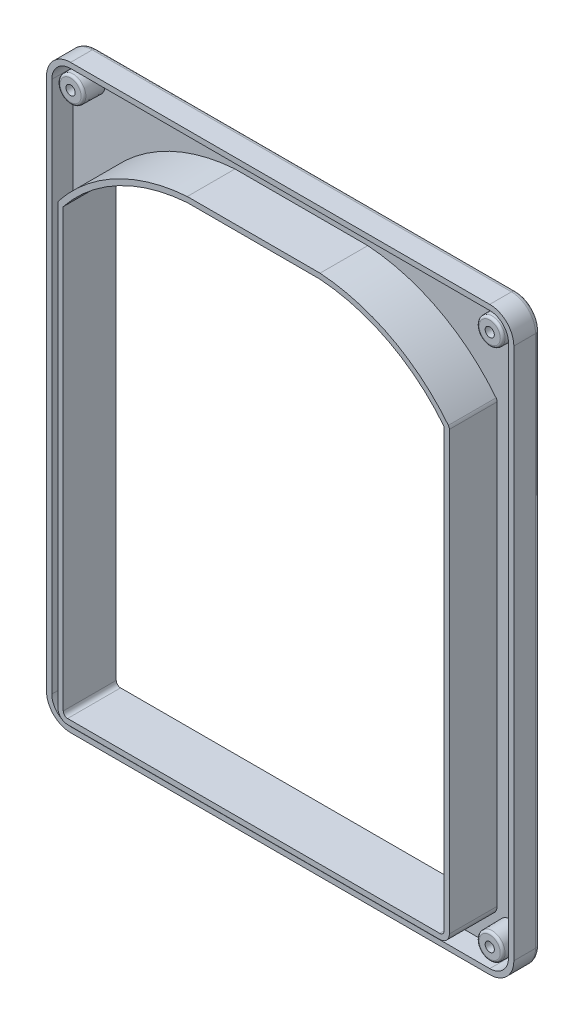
from build123d import *

# Parameters (mm, degrees)
EXTRUSION1_DEPTH                  = 22
ESQUISSE2_R                       = 1.75
EXTRUSION2_DEPTH                  = 2.2
EXTRU_MINCE1_DEPTH                = 8.8
CONG_1_R                          = 2
ESQUISSE4_R                       = 5.5
ESQUISSE4_R_2                     = 1.75
EXTRUSION3_DEPTH                  = 8.8
EXTRUSION3_DRAFT                  = 1
EXTRUSION3_PROFILE_2_DEPTH        = 8.8
EXTRUSION3_PROFILE_2_DRAFT        = 1
EXTRUSION3_PROFILE_3_DEPTH        = 8.8
EXTRUSION3_PROFILE_3_DRAFT        = 1
EXTRUSION3_PROFILE_4_DEPTH        = 8.8
EXTRUSION3_PROFILE_4_DRAFT        = 1
CONG_2_R                          = 1
ESQUISSE5_R                       = 3.675
ESQUISSE5_R_2                     = 1.75
ENL_V_MAT_EXTRU_1_DEPTH           = 8.8
ENL_V_MAT_EXTRU_1_DRAFT           = -1
ENL_V_MAT_EXTRU_1_PROFILE_2_DEPTH = 8.8
ENL_V_MAT_EXTRU_1_PROFILE_2_DRAFT = -1
ENL_V_MAT_EXTRU_1_PROFILE_3_DEPTH = 8.8
ENL_V_MAT_EXTRU_1_PROFILE_3_DRAFT = -1
ENL_V_MAT_EXTRU_1_PROFILE_4_DEPTH = 8.8
ENL_V_MAT_EXTRU_1_PROFILE_4_DRAFT = -1
CONG_3_R                          = 0.5


with BuildPart() as part:
    # Esquisse1 → Extrusion1 (new body)
    with BuildSketch(Plane.XY):
        with BuildLine():
            Line((-77.25, -107.35), (77.25, -107.35))
            ThreePointArc((77.25, -107.35), (80.078427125, -106.178427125), (81.25, -103.35))
            Line((81.25, -103.35), (81.25, 78.029814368))
            ThreePointArc((81.25, 78.029814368), (81.138764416, 78.687514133), (80.817431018, 79.272054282))
            ThreePointArc((80.817431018, 79.272054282), (57.148237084, 98.923080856), (27.561405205, 107.35))
            Line((27.561405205, 107.35), (-27.561405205, 107.35))
            ThreePointArc((-27.561405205, 107.35), (-57.148237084, 98.923080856), (-80.817431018, 79.272054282))
            ThreePointArc((-80.817431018, 79.272054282), (-81.138764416, 78.687514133), (-81.25, 78.029814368))
            Line((-81.25, 78.029814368), (-81.25, -103.35))
            ThreePointArc((-81.25, -103.35), (-80.078427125, -106.178427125), (-77.25, -107.35))
        make_face()
        with BuildLine():
            Line((-77.25, -105.15), (77.25, -105.15))
            ThreePointArc((77.25, -105.15), (78.522792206, -104.622792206), (79.05, -103.35))
            Line((79.05, -103.35), (79.05, 77.960117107))
            ThreePointArc((79.05, 77.960117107), (56.125121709, 96.975455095), (27.484068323, 105.15))
            Line((27.484068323, 105.15), (-27.484068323, 105.15))
            ThreePointArc((-27.484068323, 105.15), (-56.125121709, 96.975455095), (-79.05, 77.960117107))
            Line((-79.05, 77.960117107), (-79.05, -103.35))
            ThreePointArc((-79.05, -103.35), (-78.522792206, -104.622792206), (-77.25, -105.15))
        make_face(mode=Mode.SUBTRACT)
    extrude(amount=EXTRUSION1_DEPTH)

    # Esquisse2 → Extrusion2 (add)
    with BuildSketch(Plane.XY):
        with BuildLine():
            Line((-87, 120.35), (87, 120.35))
            ThreePointArc((87, 120.35), (94.071067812, 117.421067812), (97, 110.35))
            Line((97, 110.35), (97, -110.65))
            ThreePointArc((97, -110.65), (94.071067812, -117.721067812), (87, -120.65))
            Line((87, -120.65), (-87, -120.65))
            ThreePointArc((-87, -120.65), (-94.071067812, -117.721067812), (-97, -110.65))
            Line((-97, -110.65), (-97, 110.35))
            ThreePointArc((-97, 110.35), (-94.071067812, 117.421067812), (-87, 120.35))
        make_face()
        with Locations((87, 110.35)):
            Circle(ESQUISSE2_R, mode=Mode.SUBTRACT)
        with Locations((87, -110.65)):
            Circle(ESQUISSE2_R, mode=Mode.SUBTRACT)
        with Locations(Location((-87, 110.35, 0), (0, 0, 180))):
            Circle(ESQUISSE2_R, mode=Mode.SUBTRACT)
        with Locations((-87, -110.65)):
            Circle(ESQUISSE2_R, mode=Mode.SUBTRACT)
        with BuildLine():
            Line((-77.25, -105.15), (77.25, -105.15))
            ThreePointArc((77.25, -105.15), (78.522792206, -104.622792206), (79.05, -103.35))
            Line((79.05, -103.35), (79.05, 77.960117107))
            ThreePointArc((79.05, 77.960117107), (56.125121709, 96.975455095), (27.484068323, 105.15))
            Line((27.484068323, 105.15), (-27.484068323, 105.15))
            ThreePointArc((-27.484068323, 105.15), (-56.125121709, 96.975455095), (-79.05, 77.960117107))
            Line((-79.05, 77.960117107), (-79.05, -103.35))
            ThreePointArc((-79.05, -103.35), (-78.522792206, -104.622792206), (-77.25, -105.15))
        make_face(mode=Mode.SUBTRACT)
    extrude(amount=EXTRUSION2_DEPTH)

    # Esquisse3 → Extru.-Mince1 (add)
    with BuildSketch(Plane.XY.offset(2.2)):
        with BuildLine():
            Line((-87, -120.65), (87, -120.65))
            ThreePointArc((87, -120.65), (94.071067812, -117.721067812), (97, -110.65))
            Line((97, -110.65), (97, 110.35))
            ThreePointArc((97, 110.35), (94.071067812, 117.421067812), (87, 120.35))
            Line((87, 120.35), (-87, 120.35))
            ThreePointArc((-87, 120.35), (-94.071067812, 117.421067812), (-97, 110.35))
            Line((-97, 110.35), (-97, -110.65))
            ThreePointArc((-97, -110.65), (-94.071067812, -117.721067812), (-87, -120.65))
        make_face()
        with BuildLine():
            Line((-87, -118.45), (87, -118.45))
            ThreePointArc((87, -118.45), (92.515432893, -116.165432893), (94.8, -110.65))
            Line((94.8, -110.65), (94.8, 110.35))
            ThreePointArc((94.8, 110.35), (92.515432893, 115.865432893), (87, 118.15))
            Line((87, 118.15), (-87, 118.15))
            ThreePointArc((-87, 118.15), (-92.515432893, 115.865432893), (-94.8, 110.35))
            Line((-94.8, 110.35), (-94.8, -110.65))
            ThreePointArc((-94.8, -110.65), (-92.515432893, -116.165432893), (-87, -118.45))
        make_face(mode=Mode.SUBTRACT)
    extrude(amount=EXTRU_MINCE1_DEPTH)

    # Cong_1
    cong_1_edges = [part.edges().sort_by_distance(p)[0] for p in [
        (94.071067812, -117.721067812, 0),
        (97, -0.15, 0),
        (94.071067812, 117.421067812, 0),
        (0, 120.35, 0),
        (-94.071067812, 117.421067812, 0),
        (-97, -0.15, 0),
        (-94.071067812, -117.721067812, 0),
        (0, -120.65, 0),
    ]]
    fillet(cong_1_edges, radius=CONG_1_R)


with BuildPart() as extrusion3_tool:
    # Esquisse4 → Extrusion3 (with draft: the straight prism first)
    with BuildSketch(Plane.XY.offset(2.2)):
        with Locations((87, 110.35)):
            Circle(ESQUISSE4_R)
        with Locations((87, 110.35)):
            Circle(ESQUISSE4_R_2, mode=Mode.SUBTRACT)
    extrude(amount=EXTRUSION3_DEPTH)
    # Extrusion3: the draft: its side faces are tilted about the plane it starts from
    extrusion3_sides = [extrusion3_tool.faces().sort_by_distance(p)[0] for p in [
        (81.5, 110.35, 6.6),
        (85.25, 110.35, 6.6),
    ]]
    draft(extrusion3_sides, Plane.XY.offset(2.2), EXTRUSION3_DRAFT)


with BuildPart() as part_1:
    add(part.part)

    # Extrusion3: add extrusion3_tool
    add(extrusion3_tool.part)


with BuildPart() as extrusion3_profile_2_tool:
    # Esquisse4 → Extrusion3 profile 2 (with draft: the straight prism first)
    with BuildSketch(Plane.XY.offset(2.2)):
        with Locations((-87, 110.35)):
            Circle(ESQUISSE4_R)
        with Locations(Location((-87, 110.35, 0), (0, 0, 180))):
            Circle(ESQUISSE4_R_2, mode=Mode.SUBTRACT)
    extrude(amount=EXTRUSION3_PROFILE_2_DEPTH)
    # Extrusion3 profile 2: the draft: its side faces are tilted about the plane it starts from
    extrusion3_profile_2_sides = [extrusion3_profile_2_tool.faces().sort_by_distance(p)[0] for p in [
        (-92.5, 110.35, 6.6),
        (-85.25, 110.35, 6.6),
    ]]
    draft(extrusion3_profile_2_sides, Plane.XY.offset(2.2), EXTRUSION3_PROFILE_2_DRAFT)


with BuildPart() as part_2:
    add(part_1.part)

    # Extrusion3 profile 2: add extrusion3_profile_2_tool
    add(extrusion3_profile_2_tool.part)


with BuildPart() as extrusion3_profile_3_tool:
    # Esquisse4 → Extrusion3 profile 3 (with draft: the straight prism first)
    with BuildSketch(Plane.XY.offset(2.2)):
        with Locations((-87, -110.65)):
            Circle(ESQUISSE4_R)
        with Locations((-87, -110.65)):
            Circle(ESQUISSE4_R_2, mode=Mode.SUBTRACT)
    extrude(amount=EXTRUSION3_PROFILE_3_DEPTH)
    # Extrusion3 profile 3: the draft: its side faces are tilted about the plane it starts from
    extrusion3_profile_3_sides = [extrusion3_profile_3_tool.faces().sort_by_distance(p)[0] for p in [
        (-92.5, -110.65, 6.6),
        (-88.75, -110.65, 6.6),
    ]]
    draft(extrusion3_profile_3_sides, Plane.XY.offset(2.2), EXTRUSION3_PROFILE_3_DRAFT)


with BuildPart() as part_3:
    add(part_2.part)

    # Extrusion3 profile 3: add extrusion3_profile_3_tool
    add(extrusion3_profile_3_tool.part)


with BuildPart() as extrusion3_profile_4_tool:
    # Esquisse4 → Extrusion3 profile 4 (with draft: the straight prism first)
    with BuildSketch(Plane.XY.offset(2.2)):
        with Locations((87, -110.65)):
            Circle(ESQUISSE4_R)
        with Locations((87, -110.65)):
            Circle(ESQUISSE4_R_2, mode=Mode.SUBTRACT)
    extrude(amount=EXTRUSION3_PROFILE_4_DEPTH)
    # Extrusion3 profile 4: the draft: its side faces are tilted about the plane it starts from
    extrusion3_profile_4_sides = [extrusion3_profile_4_tool.faces().sort_by_distance(p)[0] for p in [
        (81.5, -110.65, 6.6),
        (85.25, -110.65, 6.6),
    ]]
    draft(extrusion3_profile_4_sides, Plane.XY.offset(2.2), EXTRUSION3_PROFILE_4_DRAFT)


with BuildPart() as part_4:
    add(part_3.part)

    # Extrusion3 profile 4: add extrusion3_profile_4_tool
    add(extrusion3_profile_4_tool.part)

    # Cong_2
    cong_2_edges = [part_4.edges().sort_by_distance(p)[0] for p in [
        (81.653604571, 110.35, 11),
        (-92.346395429, 110.35, 11),
        (-92.346395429, -110.65, 11),
        (81.653604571, -110.65, 11),
    ]]
    fillet(cong_2_edges, radius=CONG_2_R)


with BuildPart() as enl_v_mat_extru_1_tool:
    # Esquisse5 → Enl_v. mat.-Extru.1 (with draft: the straight prism first)
    with BuildSketch(Plane(origin=(0, 0, 0), x_dir=(-1, 0, 0), z_dir=(0, 0, -1))):
        with Locations((87, 110.35)):
            Circle(ESQUISSE5_R)
        with Locations((87, 110.35)):
            Circle(ESQUISSE5_R_2, mode=Mode.SUBTRACT)
    extrude(amount=-ENL_V_MAT_EXTRU_1_DEPTH)
    # Enl_v. mat.-Extru.1: the draft: its side faces are tilted about the plane it starts from
    enl_v_mat_extru_1_sides = [enl_v_mat_extru_1_tool.faces().sort_by_distance(p)[0] for p in [
        (-83.325, 110.35, 4.4),
        (-85.25, 110.35, 4.4),
    ]]
    draft(enl_v_mat_extru_1_sides, Plane(origin=(0, 0, 0), x_dir=(-1, 0, 0), z_dir=(0, 0, -1)), ENL_V_MAT_EXTRU_1_DRAFT)


with BuildPart() as part_5:
    add(part_4.part)

    # Enl_v. mat.-Extru.1: cut by enl_v_mat_extru_1_tool
    add(enl_v_mat_extru_1_tool.part, mode=Mode.SUBTRACT)


with BuildPart() as enl_v_mat_extru_1_profile_2_tool:
    # Esquisse5 → Enl_v. mat.-Extru.1 profile 2 (with draft: the straight prism first)
    with BuildSketch(Plane(origin=(0, 0, 0), x_dir=(-1, 0, 0), z_dir=(0, 0, -1))):
        with Locations((-87, 110.35)):
            Circle(ESQUISSE5_R)
        with Locations((-87, 110.35)):
            Circle(ESQUISSE5_R_2, mode=Mode.SUBTRACT)
    extrude(amount=-ENL_V_MAT_EXTRU_1_PROFILE_2_DEPTH)
    # Enl_v. mat.-Extru.1 profile 2: the draft: its side faces are tilted about the plane it starts from
    enl_v_mat_extru_1_profile_2_sides = [enl_v_mat_extru_1_profile_2_tool.faces().sort_by_distance(p)[0] for p in [
        (90.675, 110.35, 4.4),
        (88.75, 110.35, 4.4),
    ]]
    draft(enl_v_mat_extru_1_profile_2_sides, Plane(origin=(0, 0, 0), x_dir=(-1, 0, 0), z_dir=(0, 0, -1)), ENL_V_MAT_EXTRU_1_PROFILE_2_DRAFT)


with BuildPart() as part_6:
    add(part_5.part)

    # Enl_v. mat.-Extru.1 profile 2: cut by enl_v_mat_extru_1_profile_2_tool
    add(enl_v_mat_extru_1_profile_2_tool.part, mode=Mode.SUBTRACT)


with BuildPart() as enl_v_mat_extru_1_profile_3_tool:
    # Esquisse5 → Enl_v. mat.-Extru.1 profile 3 (with draft: the straight prism first)
    with BuildSketch(Plane(origin=(0, 0, 0), x_dir=(-1, 0, 0), z_dir=(0, 0, -1))):
        with Locations((-87, -110.65)):
            Circle(ESQUISSE5_R)
        with Locations((-87, -110.65)):
            Circle(ESQUISSE5_R_2, mode=Mode.SUBTRACT)
    extrude(amount=-ENL_V_MAT_EXTRU_1_PROFILE_3_DEPTH)
    # Enl_v. mat.-Extru.1 profile 3: the draft: its side faces are tilted about the plane it starts from
    enl_v_mat_extru_1_profile_3_sides = [enl_v_mat_extru_1_profile_3_tool.faces().sort_by_distance(p)[0] for p in [
        (90.675, -110.65, 4.4),
        (88.75, -110.65, 4.4),
    ]]
    draft(enl_v_mat_extru_1_profile_3_sides, Plane(origin=(0, 0, 0), x_dir=(-1, 0, 0), z_dir=(0, 0, -1)), ENL_V_MAT_EXTRU_1_PROFILE_3_DRAFT)


with BuildPart() as part_7:
    add(part_6.part)

    # Enl_v. mat.-Extru.1 profile 3: cut by enl_v_mat_extru_1_profile_3_tool
    add(enl_v_mat_extru_1_profile_3_tool.part, mode=Mode.SUBTRACT)


with BuildPart() as enl_v_mat_extru_1_profile_4_tool:
    # Esquisse5 → Enl_v. mat.-Extru.1 profile 4 (with draft: the straight prism first)
    with BuildSketch(Plane(origin=(0, 0, 0), x_dir=(-1, 0, 0), z_dir=(0, 0, -1))):
        with Locations((87, -110.65)):
            Circle(ESQUISSE5_R)
        with Locations((87, -110.65)):
            Circle(ESQUISSE5_R_2, mode=Mode.SUBTRACT)
    extrude(amount=-ENL_V_MAT_EXTRU_1_PROFILE_4_DEPTH)
    # Enl_v. mat.-Extru.1 profile 4: the draft: its side faces are tilted about the plane it starts from
    enl_v_mat_extru_1_profile_4_sides = [enl_v_mat_extru_1_profile_4_tool.faces().sort_by_distance(p)[0] for p in [
        (-83.325, -110.65, 4.4),
        (-85.25, -110.65, 4.4),
    ]]
    draft(enl_v_mat_extru_1_profile_4_sides, Plane(origin=(0, 0, 0), x_dir=(-1, 0, 0), z_dir=(0, 0, -1)), ENL_V_MAT_EXTRU_1_PROFILE_4_DRAFT)


with BuildPart() as part_8:
    add(part_7.part)

    # Enl_v. mat.-Extru.1 profile 4: cut by enl_v_mat_extru_1_profile_4_tool
    add(enl_v_mat_extru_1_profile_4_tool.part, mode=Mode.SUBTRACT)

    # Cong_3
    cong_3_edges = [part_8.edges().sort_by_distance(p)[0] for p in [
        (-83.325, 110.35, 0),
        (90.675, 110.35, 0),
        (90.675, -110.65, 0),
        (-83.325, -110.65, 0),
    ]]
    fillet(cong_3_edges, radius=CONG_3_R)


solid = part_8.part
